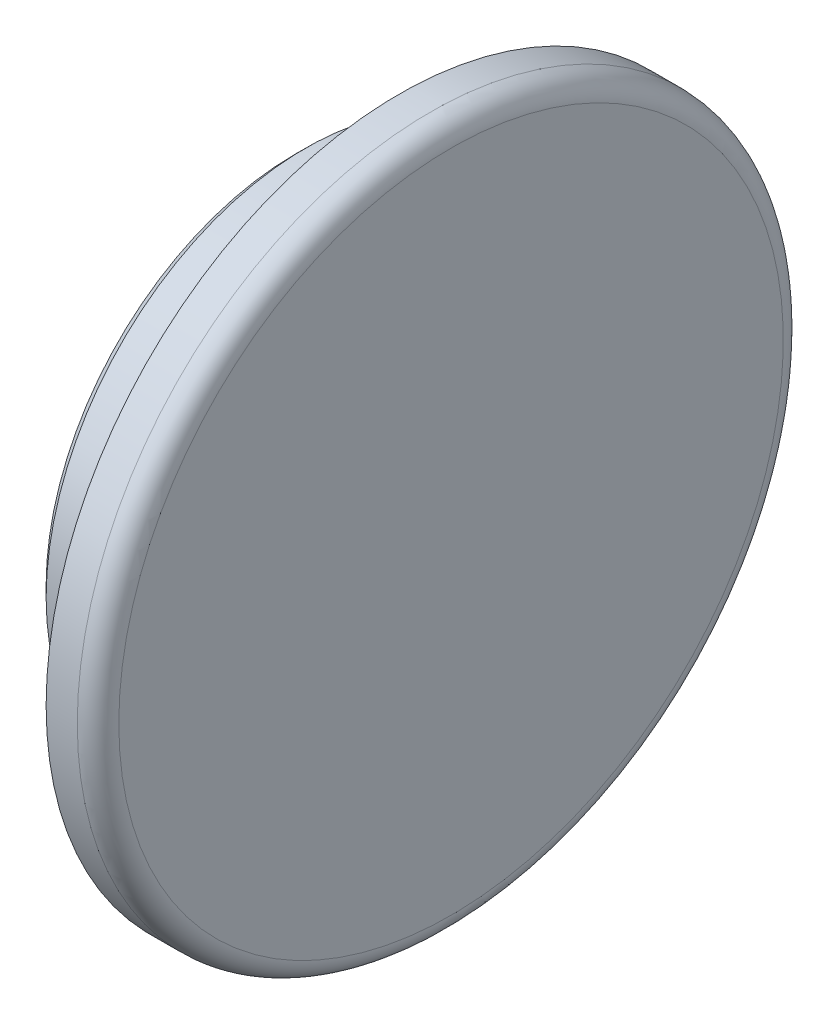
from build123d import *

# Parameters (mm, degrees)
CONG_1_R        = 1
CHANFREIN1_SIZE = 0.5


with BuildPart() as part:
    # Esquisse1 → R_volution1 (revolve)
    with BuildSketch(Plane.XY, mode=Mode.PRIVATE) as r_volution1_sk:
        Polygon((0, 12.5), (5, 12.5), (5, 17), (7.5, 17), (7.5, 0), (5, 0), (5, 10.5), (0, 10.5), align=None)
    revolve(r_volution1_sk.sketch.rotate(Axis((-7.215433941, 0, 0), (1, 0, 0)), 90), axis=Axis((-7.215433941, 0, 0), (1, 0, 0)))

    # Cong_1
    cong_1_edges = [part.edges().sort_by_distance(p)[0] for p in [
        (7.5, 0, -17),
    ]]
    fillet(cong_1_edges, radius=CONG_1_R)

    # Chanfrein1
    chanfrein1_edges = [part.edges().sort_by_distance(p)[0] for p in [
        (0, 0, -12.5),
    ]]
    chamfer(chanfrein1_edges, length=CHANFREIN1_SIZE)


solid = part.part
